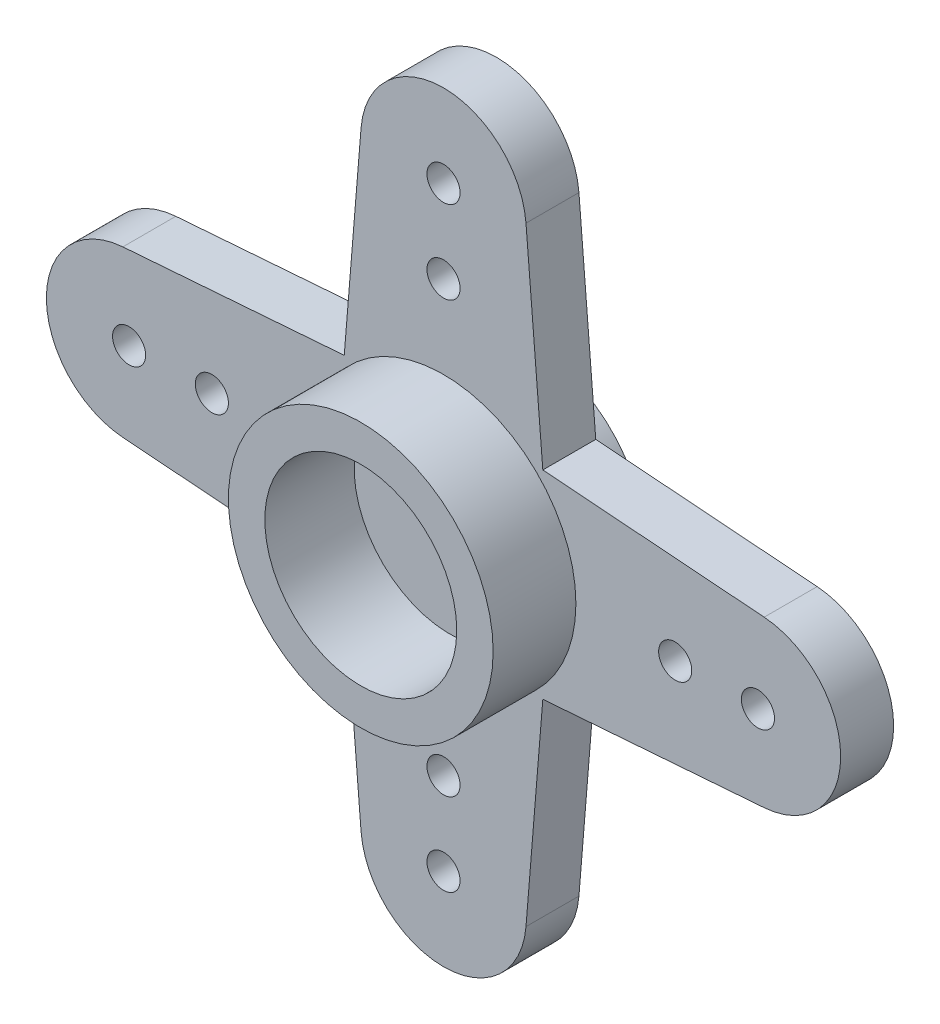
ISO-10303-21;
HEADER;
FILE_DESCRIPTION(('STEP AP214'),'2;1');
FILE_NAME('part.step','',(''),(''),'','','');
FILE_SCHEMA(('AUTOMOTIVE_DESIGN { 1 0 10303 214 1 1 1 1 }'));
ENDSEC;
DATA;
#1=APPLICATION_CONTEXT('core data for automotive mechanical design processes');
#2=APPLICATION_PROTOCOL_DEFINITION('international standard','automotive_design',2000,#1);
#3=PRODUCT_CONTEXT('',#1,'mechanical');
#4=PRODUCT('Part','Part','',(#3));
#5=PRODUCT_RELATED_PRODUCT_CATEGORY('part','',(#4));
#6=PRODUCT_DEFINITION_FORMATION('','',#4);
#7=PRODUCT_DEFINITION_CONTEXT('part definition',#1,'design');
#8=PRODUCT_DEFINITION('design','',#6,#7);
#9=PRODUCT_DEFINITION_SHAPE('','',#8);
#10=(LENGTH_UNIT() NAMED_UNIT(*) SI_UNIT(.MILLI.,.METRE.));
#11=(NAMED_UNIT(*) PLANE_ANGLE_UNIT() SI_UNIT($,.RADIAN.));
#12=(NAMED_UNIT(*) SI_UNIT($,.STERADIAN.) SOLID_ANGLE_UNIT());
#13=UNCERTAINTY_MEASURE_WITH_UNIT(LENGTH_MEASURE(1.E-05),#10,'distance_accuracy_value','');
#14=(GEOMETRIC_REPRESENTATION_CONTEXT(3) GLOBAL_UNCERTAINTY_ASSIGNED_CONTEXT((#13)) GLOBAL_UNIT_ASSIGNED_CONTEXT((#10,
#11,#12)) REPRESENTATION_CONTEXT('',''));
#15=CARTESIAN_POINT('',(0.,0.,0.));
#16=DIRECTION('',(0.,0.,1.));
#17=DIRECTION('',(1.,0.,0.));
#18=AXIS2_PLACEMENT_3D('',#15,#16,#17);
#19=CARTESIAN_POINT('',(0.,-9.,1.6));
#20=DIRECTION('',(0.,0.,1.));
#21=DIRECTION('',(1.,0.,0.));
#22=AXIS2_PLACEMENT_3D('',#19,#20,#21);
#23=PLANE('',#22);
#24=CARTESIAN_POINT('',(0.,-9.,1.6));
#25=DIRECTION('',(0.,0.,1.));
#26=DIRECTION('',(1.,0.,0.));
#27=AXIS2_PLACEMENT_3D('',#24,#25,#26);
#28=CIRCLE('',#27,0.5);
#29=CARTESIAN_POINT('',(0.5,-9.,1.6));
#30=VERTEX_POINT('',#29);
#31=EDGE_CURVE('E530',#30,#30,#28,.T.);
#32=ORIENTED_EDGE('',*,*,#31,.F.);
#33=EDGE_LOOP('',(#32));
#34=FACE_BOUND('',#33,.T.);
#35=CARTESIAN_POINT('',(0.,6.5,1.6));
#36=DIRECTION('',(0.,0.,1.));
#37=DIRECTION('',(1.,0.,0.));
#38=AXIS2_PLACEMENT_3D('',#35,#36,#37);
#39=CIRCLE('',#38,0.500000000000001);
#40=CARTESIAN_POINT('',(0.500000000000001,6.5,1.6));
#41=VERTEX_POINT('',#40);
#42=EDGE_CURVE('E542',#41,#41,#39,.T.);
#43=ORIENTED_EDGE('',*,*,#42,.F.);
#44=EDGE_LOOP('',(#43));
#45=FACE_BOUND('',#44,.T.);
#46=CARTESIAN_POINT('',(7.,0.,1.6));
#47=DIRECTION('',(0.,0.,1.));
#48=DIRECTION('',(1.,0.,0.));
#49=AXIS2_PLACEMENT_3D('',#46,#47,#48);
#50=CIRCLE('',#49,0.500000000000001);
#51=CARTESIAN_POINT('',(7.5,0.,1.6));
#52=VERTEX_POINT('',#51);
#53=EDGE_CURVE('E554',#52,#52,#50,.T.);
#54=ORIENTED_EDGE('',*,*,#53,.F.);
#55=EDGE_LOOP('',(#54));
#56=FACE_BOUND('',#55,.T.);
#57=CARTESIAN_POINT('',(-9.5,0.,1.6));
#58=DIRECTION('',(0.,0.,1.));
#59=DIRECTION('',(1.,0.,0.));
#60=AXIS2_PLACEMENT_3D('',#57,#58,#59);
#61=CIRCLE('',#60,0.500000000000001);
#62=CARTESIAN_POINT('',(-9.,0.,1.6));
#63=VERTEX_POINT('',#62);
#64=EDGE_CURVE('E566',#63,#63,#61,.T.);
#65=ORIENTED_EDGE('',*,*,#64,.F.);
#66=EDGE_LOOP('',(#65));
#67=FACE_BOUND('',#66,.T.);
#68=DIRECTION('',(0.0816633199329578,0.996659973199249,0.));
#69=VECTOR('',#68,1.);
#70=CARTESIAN_POINT('',(3.,-3.,1.6));
#71=LINE('',#70,#69);
#72=CARTESIAN_POINT('',(2.49164993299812,-9.20415829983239,1.6));
#73=VERTEX_POINT('',#72);
#74=CARTESIAN_POINT('',(3.,-3.,1.6));
#75=VERTEX_POINT('',#74);
#76=EDGE_CURVE('E179',#73,#75,#71,.T.);
#77=ORIENTED_EDGE('',*,*,#76,.T.);
#78=DIRECTION('',(0.997138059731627,0.0756021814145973,0.));
#79=VECTOR('',#78,1.);
#80=CARTESIAN_POINT('',(9.68900545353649,-2.49284514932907,1.6));
#81=LINE('',#80,#79);
#82=CARTESIAN_POINT('',(9.68900545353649,-2.49284514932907,1.6));
#83=VERTEX_POINT('',#82);
#84=EDGE_CURVE('E107',#75,#83,#81,.T.);
#85=ORIENTED_EDGE('',*,*,#84,.T.);
#86=CARTESIAN_POINT('',(9.5,0.,1.6));
#87=DIRECTION('',(0.,0.,1.));
#88=DIRECTION('',(1.,0.,0.));
#89=AXIS2_PLACEMENT_3D('',#86,#87,#88);
#90=CIRCLE('',#89,2.5);
#91=CARTESIAN_POINT('',(9.68900545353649,2.49284514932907,1.6));
#92=VERTEX_POINT('',#91);
#93=EDGE_CURVE('E225',#83,#92,#90,.T.);
#94=ORIENTED_EDGE('',*,*,#93,.T.);
#95=DIRECTION('',(-0.997138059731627,0.0756021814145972,0.));
#96=VECTOR('',#95,1.);
#97=CARTESIAN_POINT('',(3.,3.,1.6));
#98=LINE('',#97,#96);
#99=CARTESIAN_POINT('',(3.,3.,1.6));
#100=VERTEX_POINT('',#99);
#101=EDGE_CURVE('E222',#92,#100,#98,.T.);
#102=ORIENTED_EDGE('',*,*,#101,.T.);
#103=DIRECTION('',(-0.0816633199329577,0.996659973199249,0.));
#104=VECTOR('',#103,1.);
#105=CARTESIAN_POINT('',(3.,3.,1.6));
#106=LINE('',#105,#104);
#107=CARTESIAN_POINT('',(2.49164993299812,9.20415829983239,1.6));
#108=VERTEX_POINT('',#107);
#109=EDGE_CURVE('E224',#100,#108,#106,.T.);
#110=ORIENTED_EDGE('',*,*,#109,.T.);
#111=CARTESIAN_POINT('',(0.,9.,1.6));
#112=DIRECTION('',(0.,0.,1.));
#113=DIRECTION('',(1.,0.,0.));
#114=AXIS2_PLACEMENT_3D('',#111,#112,#113);
#115=CIRCLE('',#114,2.5);
#116=CARTESIAN_POINT('',(-2.49164993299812,9.20415829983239,1.6));
#117=VERTEX_POINT('',#116);
#118=EDGE_CURVE('E227',#108,#117,#115,.T.);
#119=ORIENTED_EDGE('',*,*,#118,.T.);
#120=DIRECTION('',(-0.0816633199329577,-0.996659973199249,0.));
#121=VECTOR('',#120,1.);
#122=CARTESIAN_POINT('',(-3.,3.,1.6));
#123=LINE('',#122,#121);
#124=CARTESIAN_POINT('',(-3.,3.,1.6));
#125=VERTEX_POINT('',#124);
#126=EDGE_CURVE('E233',#117,#125,#123,.T.);
#127=ORIENTED_EDGE('',*,*,#126,.T.);
#128=DIRECTION('',(-0.997138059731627,-0.0756021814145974,0.));
#129=VECTOR('',#128,1.);
#130=CARTESIAN_POINT('',(-9.68900545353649,2.49284514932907,1.6));
#131=LINE('',#130,#129);
#132=CARTESIAN_POINT('',(-9.68900545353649,2.49284514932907,1.6));
#133=VERTEX_POINT('',#132);
#134=EDGE_CURVE('E235',#125,#133,#131,.T.);
#135=ORIENTED_EDGE('',*,*,#134,.T.);
#136=CARTESIAN_POINT('',(-9.5,0.,1.6));
#137=DIRECTION('',(0.,0.,1.));
#138=DIRECTION('',(1.,0.,0.));
#139=AXIS2_PLACEMENT_3D('',#136,#137,#138);
#140=CIRCLE('',#139,2.5);
#141=CARTESIAN_POINT('',(-9.6890054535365,-2.49284514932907,1.6));
#142=VERTEX_POINT('',#141);
#143=EDGE_CURVE('E138',#133,#142,#140,.T.);
#144=ORIENTED_EDGE('',*,*,#143,.T.);
#145=DIRECTION('',(0.997138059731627,-0.0756021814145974,0.));
#146=VECTOR('',#145,1.);
#147=CARTESIAN_POINT('',(-9.68900545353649,-2.49284514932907,1.6));
#148=LINE('',#147,#146);
#149=CARTESIAN_POINT('',(-3.,-3.,1.6));
#150=VERTEX_POINT('',#149);
#151=EDGE_CURVE('E132',#142,#150,#148,.T.);
#152=ORIENTED_EDGE('',*,*,#151,.T.);
#153=DIRECTION('',(0.0816633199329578,-0.996659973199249,0.));
#154=VECTOR('',#153,1.);
#155=CARTESIAN_POINT('',(-3.,-3.,1.6));
#156=LINE('',#155,#154);
#157=CARTESIAN_POINT('',(-2.49164993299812,-9.20415829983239,1.6));
#158=VERTEX_POINT('',#157);
#159=EDGE_CURVE('E136',#150,#158,#156,.T.);
#160=ORIENTED_EDGE('',*,*,#159,.T.);
#161=CARTESIAN_POINT('',(0.,-9.,1.6));
#162=DIRECTION('',(0.,0.,1.));
#163=DIRECTION('',(1.,0.,0.));
#164=AXIS2_PLACEMENT_3D('',#161,#162,#163);
#165=CIRCLE('',#164,2.5);
#166=EDGE_CURVE('E51',#158,#73,#165,.T.);
#167=ORIENTED_EDGE('',*,*,#166,.T.);
#168=EDGE_LOOP('',(#77,#85,#94,#102,#110,#119,#127,#135,#144,#152,#160,#167));
#169=FACE_BOUND('',#168,.T.);
#170=CARTESIAN_POINT('',(0.,9.,1.6));
#171=DIRECTION('',(0.,0.,1.));
#172=DIRECTION('',(1.,0.,0.));
#173=AXIS2_PLACEMENT_3D('',#170,#171,#172);
#174=CIRCLE('',#173,0.500000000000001);
#175=CARTESIAN_POINT('',(0.500000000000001,9.,1.6));
#176=VERTEX_POINT('',#175);
#177=EDGE_CURVE('E160',#176,#176,#174,.T.);
#178=ORIENTED_EDGE('',*,*,#177,.F.);
#179=EDGE_LOOP('',(#178));
#180=FACE_BOUND('',#179,.T.);
#181=CARTESIAN_POINT('',(-7.,0.,1.6));
#182=DIRECTION('',(0.,0.,1.));
#183=DIRECTION('',(1.,0.,0.));
#184=AXIS2_PLACEMENT_3D('',#181,#182,#183);
#185=CIRCLE('',#184,0.500000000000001);
#186=CARTESIAN_POINT('',(-6.5,0.,1.6));
#187=VERTEX_POINT('',#186);
#188=EDGE_CURVE('E560',#187,#187,#185,.T.);
#189=ORIENTED_EDGE('',*,*,#188,.F.);
#190=EDGE_LOOP('',(#189));
#191=FACE_BOUND('',#190,.T.);
#192=CARTESIAN_POINT('',(9.5,0.,1.6));
#193=DIRECTION('',(0.,0.,1.));
#194=DIRECTION('',(1.,0.,0.));
#195=AXIS2_PLACEMENT_3D('',#192,#193,#194);
#196=CIRCLE('',#195,0.500000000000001);
#197=CARTESIAN_POINT('',(10.,0.,1.6));
#198=VERTEX_POINT('',#197);
#199=EDGE_CURVE('E548',#198,#198,#196,.T.);
#200=ORIENTED_EDGE('',*,*,#199,.F.);
#201=EDGE_LOOP('',(#200));
#202=FACE_BOUND('',#201,.T.);
#203=CARTESIAN_POINT('',(0.,-6.5,1.6));
#204=DIRECTION('',(0.,0.,1.));
#205=DIRECTION('',(1.,0.,0.));
#206=AXIS2_PLACEMENT_3D('',#203,#204,#205);
#207=CIRCLE('',#206,0.5);
#208=CARTESIAN_POINT('',(0.5,-6.5,1.6));
#209=VERTEX_POINT('',#208);
#210=EDGE_CURVE('E536',#209,#209,#207,.T.);
#211=ORIENTED_EDGE('',*,*,#210,.F.);
#212=EDGE_LOOP('',(#211));
#213=FACE_BOUND('',#212,.T.);
#214=CARTESIAN_POINT('',(0.,0.,1.6));
#215=DIRECTION('',(0.,0.,1.));
#216=DIRECTION('',(1.,0.,0.));
#217=AXIS2_PLACEMENT_3D('',#214,#215,#216);
#218=CIRCLE('',#217,4.);
#219=CARTESIAN_POINT('',(4.,0.,1.6));
#220=VERTEX_POINT('',#219);
#221=EDGE_CURVE('E515',#220,#220,#218,.T.);
#222=ORIENTED_EDGE('',*,*,#221,.F.);
#223=EDGE_LOOP('',(#222));
#224=FACE_BOUND('',#223,.T.);
#225=ADVANCED_FACE('F34',(#34,#45,#56,#67,#169,#180,#191,#202,#213,#224),#23,.T.);
#226=CARTESIAN_POINT('',(0.,-9.,0.));
#227=DIRECTION('',(0.,0.,1.));
#228=DIRECTION('',(1.,0.,0.));
#229=AXIS2_PLACEMENT_3D('',#226,#227,#228);
#230=PLANE('',#229);
#231=CARTESIAN_POINT('',(0.,-9.,0.));
#232=DIRECTION('',(0.,0.,1.));
#233=DIRECTION('',(1.,0.,0.));
#234=AXIS2_PLACEMENT_3D('',#231,#232,#233);
#235=CIRCLE('',#234,0.5);
#236=CARTESIAN_POINT('',(0.5,-9.,0.));
#237=VERTEX_POINT('',#236);
#238=EDGE_CURVE('E529',#237,#237,#235,.T.);
#239=ORIENTED_EDGE('',*,*,#238,.T.);
#240=EDGE_LOOP('',(#239));
#241=FACE_BOUND('',#240,.T.);
#242=CARTESIAN_POINT('',(0.,6.5,0.));
#243=DIRECTION('',(0.,0.,1.));
#244=DIRECTION('',(1.,0.,0.));
#245=AXIS2_PLACEMENT_3D('',#242,#243,#244);
#246=CIRCLE('',#245,0.500000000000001);
#247=CARTESIAN_POINT('',(0.500000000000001,6.5,0.));
#248=VERTEX_POINT('',#247);
#249=EDGE_CURVE('E539',#248,#248,#246,.T.);
#250=ORIENTED_EDGE('',*,*,#249,.T.);
#251=EDGE_LOOP('',(#250));
#252=FACE_BOUND('',#251,.T.);
#253=CARTESIAN_POINT('',(7.,0.,0.));
#254=DIRECTION('',(0.,0.,1.));
#255=DIRECTION('',(1.,0.,0.));
#256=AXIS2_PLACEMENT_3D('',#253,#254,#255);
#257=CIRCLE('',#256,0.500000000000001);
#258=CARTESIAN_POINT('',(7.5,0.,0.));
#259=VERTEX_POINT('',#258);
#260=EDGE_CURVE('E551',#259,#259,#257,.T.);
#261=ORIENTED_EDGE('',*,*,#260,.T.);
#262=EDGE_LOOP('',(#261));
#263=FACE_BOUND('',#262,.T.);
#264=CARTESIAN_POINT('',(-9.5,0.,0.));
#265=DIRECTION('',(0.,0.,1.));
#266=DIRECTION('',(1.,0.,0.));
#267=AXIS2_PLACEMENT_3D('',#264,#265,#266);
#268=CIRCLE('',#267,0.500000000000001);
#269=CARTESIAN_POINT('',(-9.,0.,0.));
#270=VERTEX_POINT('',#269);
#271=EDGE_CURVE('E563',#270,#270,#268,.T.);
#272=ORIENTED_EDGE('',*,*,#271,.T.);
#273=EDGE_LOOP('',(#272));
#274=FACE_BOUND('',#273,.T.);
#275=DIRECTION('',(0.0816633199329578,0.996659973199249,0.));
#276=VECTOR('',#275,1.);
#277=CARTESIAN_POINT('',(3.,-3.,0.));
#278=LINE('',#277,#276);
#279=CARTESIAN_POINT('',(2.49164993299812,-9.20415829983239,0.));
#280=VERTEX_POINT('',#279);
#281=CARTESIAN_POINT('',(3.,-3.,0.));
#282=VERTEX_POINT('',#281);
#283=EDGE_CURVE('E156',#280,#282,#278,.T.);
#284=ORIENTED_EDGE('',*,*,#283,.F.);
#285=CARTESIAN_POINT('',(0.,-9.,0.));
#286=DIRECTION('',(0.,0.,1.));
#287=DIRECTION('',(1.,0.,0.));
#288=AXIS2_PLACEMENT_3D('',#285,#286,#287);
#289=CIRCLE('',#288,2.5);
#290=CARTESIAN_POINT('',(-2.49164993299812,-9.20415829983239,0.));
#291=VERTEX_POINT('',#290);
#292=EDGE_CURVE('E98',#291,#280,#289,.T.);
#293=ORIENTED_EDGE('',*,*,#292,.F.);
#294=DIRECTION('',(0.0816633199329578,-0.996659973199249,0.));
#295=VECTOR('',#294,1.);
#296=CARTESIAN_POINT('',(-3.,-3.,0.));
#297=LINE('',#296,#295);
#298=CARTESIAN_POINT('',(-3.,-3.,0.));
#299=VERTEX_POINT('',#298);
#300=EDGE_CURVE('E92',#299,#291,#297,.T.);
#301=ORIENTED_EDGE('',*,*,#300,.F.);
#302=DIRECTION('',(0.997138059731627,-0.0756021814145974,0.));
#303=VECTOR('',#302,1.);
#304=CARTESIAN_POINT('',(-9.68900545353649,-2.49284514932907,0.));
#305=LINE('',#304,#303);
#306=CARTESIAN_POINT('',(-9.6890054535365,-2.49284514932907,0.));
#307=VERTEX_POINT('',#306);
#308=EDGE_CURVE('E146',#307,#299,#305,.T.);
#309=ORIENTED_EDGE('',*,*,#308,.F.);
#310=CARTESIAN_POINT('',(-9.5,0.,0.));
#311=DIRECTION('',(0.,0.,1.));
#312=DIRECTION('',(1.,0.,0.));
#313=AXIS2_PLACEMENT_3D('',#310,#311,#312);
#314=CIRCLE('',#313,2.5);
#315=CARTESIAN_POINT('',(-9.68900545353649,2.49284514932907,0.));
#316=VERTEX_POINT('',#315);
#317=EDGE_CURVE('E174',#316,#307,#314,.T.);
#318=ORIENTED_EDGE('',*,*,#317,.F.);
#319=DIRECTION('',(-0.997138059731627,-0.0756021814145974,0.));
#320=VECTOR('',#319,1.);
#321=CARTESIAN_POINT('',(-9.68900545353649,2.49284514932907,0.));
#322=LINE('',#321,#320);
#323=CARTESIAN_POINT('',(-3.,3.,0.));
#324=VERTEX_POINT('',#323);
#325=EDGE_CURVE('E172',#324,#316,#322,.T.);
#326=ORIENTED_EDGE('',*,*,#325,.F.);
#327=DIRECTION('',(-0.0816633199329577,-0.996659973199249,0.));
#328=VECTOR('',#327,1.);
#329=CARTESIAN_POINT('',(-3.,3.,0.));
#330=LINE('',#329,#328);
#331=CARTESIAN_POINT('',(-2.49164993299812,9.20415829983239,0.));
#332=VERTEX_POINT('',#331);
#333=EDGE_CURVE('E170',#332,#324,#330,.T.);
#334=ORIENTED_EDGE('',*,*,#333,.F.);
#335=CARTESIAN_POINT('',(0.,9.,0.));
#336=DIRECTION('',(0.,0.,1.));
#337=DIRECTION('',(1.,0.,0.));
#338=AXIS2_PLACEMENT_3D('',#335,#336,#337);
#339=CIRCLE('',#338,2.5);
#340=CARTESIAN_POINT('',(2.49164993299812,9.20415829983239,0.));
#341=VERTEX_POINT('',#340);
#342=EDGE_CURVE('E168',#341,#332,#339,.T.);
#343=ORIENTED_EDGE('',*,*,#342,.F.);
#344=DIRECTION('',(-0.0816633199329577,0.996659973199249,0.));
#345=VECTOR('',#344,1.);
#346=CARTESIAN_POINT('',(3.,3.,0.));
#347=LINE('',#346,#345);
#348=CARTESIAN_POINT('',(3.,3.,0.));
#349=VERTEX_POINT('',#348);
#350=EDGE_CURVE('E166',#349,#341,#347,.T.);
#351=ORIENTED_EDGE('',*,*,#350,.F.);
#352=DIRECTION('',(-0.997138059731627,0.0756021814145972,0.));
#353=VECTOR('',#352,1.);
#354=CARTESIAN_POINT('',(3.,3.,0.));
#355=LINE('',#354,#353);
#356=CARTESIAN_POINT('',(9.68900545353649,2.49284514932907,0.));
#357=VERTEX_POINT('',#356);
#358=EDGE_CURVE('E164',#357,#349,#355,.T.);
#359=ORIENTED_EDGE('',*,*,#358,.F.);
#360=CARTESIAN_POINT('',(9.5,0.,0.));
#361=DIRECTION('',(0.,0.,1.));
#362=DIRECTION('',(1.,0.,0.));
#363=AXIS2_PLACEMENT_3D('',#360,#361,#362);
#364=CIRCLE('',#363,2.5);
#365=CARTESIAN_POINT('',(9.68900545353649,-2.49284514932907,0.));
#366=VERTEX_POINT('',#365);
#367=EDGE_CURVE('E162',#366,#357,#364,.T.);
#368=ORIENTED_EDGE('',*,*,#367,.F.);
#369=DIRECTION('',(0.997138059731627,0.0756021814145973,0.));
#370=VECTOR('',#369,1.);
#371=CARTESIAN_POINT('',(9.68900545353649,-2.49284514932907,0.));
#372=LINE('',#371,#370);
#373=EDGE_CURVE('E159',#282,#366,#372,.T.);
#374=ORIENTED_EDGE('',*,*,#373,.F.);
#375=EDGE_LOOP('',(#284,#293,#301,#309,#318,#326,#334,#343,#351,#359,#368,#374));
#376=FACE_BOUND('',#375,.T.);
#377=CARTESIAN_POINT('',(0.,9.,0.));
#378=DIRECTION('',(0.,0.,1.));
#379=DIRECTION('',(1.,0.,0.));
#380=AXIS2_PLACEMENT_3D('',#377,#378,#379);
#381=CIRCLE('',#380,0.500000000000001);
#382=CARTESIAN_POINT('',(0.500000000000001,9.,0.));
#383=VERTEX_POINT('',#382);
#384=EDGE_CURVE('E569',#383,#383,#381,.T.);
#385=ORIENTED_EDGE('',*,*,#384,.T.);
#386=EDGE_LOOP('',(#385));
#387=FACE_BOUND('',#386,.T.);
#388=CARTESIAN_POINT('',(-7.,0.,0.));
#389=DIRECTION('',(0.,0.,1.));
#390=DIRECTION('',(1.,0.,0.));
#391=AXIS2_PLACEMENT_3D('',#388,#389,#390);
#392=CIRCLE('',#391,0.500000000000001);
#393=CARTESIAN_POINT('',(-6.5,0.,0.));
#394=VERTEX_POINT('',#393);
#395=EDGE_CURVE('E557',#394,#394,#392,.T.);
#396=ORIENTED_EDGE('',*,*,#395,.T.);
#397=EDGE_LOOP('',(#396));
#398=FACE_BOUND('',#397,.T.);
#399=CARTESIAN_POINT('',(9.5,0.,0.));
#400=DIRECTION('',(0.,0.,1.));
#401=DIRECTION('',(1.,0.,0.));
#402=AXIS2_PLACEMENT_3D('',#399,#400,#401);
#403=CIRCLE('',#402,0.500000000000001);
#404=CARTESIAN_POINT('',(10.,0.,0.));
#405=VERTEX_POINT('',#404);
#406=EDGE_CURVE('E545',#405,#405,#403,.T.);
#407=ORIENTED_EDGE('',*,*,#406,.T.);
#408=EDGE_LOOP('',(#407));
#409=FACE_BOUND('',#408,.T.);
#410=CARTESIAN_POINT('',(0.,-6.5,0.));
#411=DIRECTION('',(0.,0.,1.));
#412=DIRECTION('',(1.,0.,0.));
#413=AXIS2_PLACEMENT_3D('',#410,#411,#412);
#414=CIRCLE('',#413,0.5);
#415=CARTESIAN_POINT('',(0.5,-6.5,0.));
#416=VERTEX_POINT('',#415);
#417=EDGE_CURVE('E533',#416,#416,#414,.T.);
#418=ORIENTED_EDGE('',*,*,#417,.T.);
#419=EDGE_LOOP('',(#418));
#420=FACE_BOUND('',#419,.T.);
#421=CARTESIAN_POINT('',(0.,0.,0.));
#422=DIRECTION('',(0.,0.,1.));
#423=DIRECTION('',(1.,0.,0.));
#424=AXIS2_PLACEMENT_3D('',#421,#422,#423);
#425=CIRCLE('',#424,3.5);
#426=CARTESIAN_POINT('',(3.5,0.,0.));
#427=VERTEX_POINT('',#426);
#428=EDGE_CURVE('E11',#427,#427,#425,.F.);
#429=ORIENTED_EDGE('',*,*,#428,.F.);
#430=EDGE_LOOP('',(#429));
#431=FACE_BOUND('',#430,.T.);
#432=ADVANCED_FACE('F209',(#241,#252,#263,#274,#376,#387,#398,#409,#420,#431),#230,.F.);
#433=CARTESIAN_POINT('',(3.,-3.,1.6));
#434=DIRECTION('',(-0.996659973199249,0.0816633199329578,0.));
#435=DIRECTION('',(-0.0816633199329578,-0.996659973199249,0.));
#436=AXIS2_PLACEMENT_3D('',#433,#434,#435);
#437=PLANE('',#436);
#438=ORIENTED_EDGE('',*,*,#283,.T.);
#439=DIRECTION('',(0.,0.,-1.));
#440=VECTOR('',#439,1.);
#441=CARTESIAN_POINT('',(3.,-3.,1.6));
#442=LINE('',#441,#440);
#443=EDGE_CURVE('E43',#75,#282,#442,.T.);
#444=ORIENTED_EDGE('',*,*,#443,.F.);
#445=ORIENTED_EDGE('',*,*,#76,.F.);
#446=DIRECTION('',(0.,0.,-1.));
#447=VECTOR('',#446,1.);
#448=CARTESIAN_POINT('',(2.49164993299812,-9.20415829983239,1.6));
#449=LINE('',#448,#447);
#450=EDGE_CURVE('E152',#73,#280,#449,.T.);
#451=ORIENTED_EDGE('',*,*,#450,.T.);
#452=EDGE_LOOP('',(#438,#444,#445,#451));
#453=FACE_BOUND('',#452,.T.);
#454=ADVANCED_FACE('F36',(#453),#437,.F.);
#455=CARTESIAN_POINT('',(9.68900545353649,-2.49284514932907,1.6));
#456=DIRECTION('',(-0.0756021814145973,0.997138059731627,0.));
#457=DIRECTION('',(-0.997138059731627,-0.0756021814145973,0.));
#458=AXIS2_PLACEMENT_3D('',#455,#456,#457);
#459=PLANE('',#458);
#460=ORIENTED_EDGE('',*,*,#373,.T.);
#461=DIRECTION('',(0.,0.,-1.));
#462=VECTOR('',#461,1.);
#463=CARTESIAN_POINT('',(9.68900545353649,-2.49284514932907,1.6));
#464=LINE('',#463,#462);
#465=EDGE_CURVE('E201',#83,#366,#464,.T.);
#466=ORIENTED_EDGE('',*,*,#465,.F.);
#467=ORIENTED_EDGE('',*,*,#84,.F.);
#468=ORIENTED_EDGE('',*,*,#443,.T.);
#469=EDGE_LOOP('',(#460,#466,#467,#468));
#470=FACE_BOUND('',#469,.T.);
#471=ADVANCED_FACE('F204',(#470),#459,.F.);
#472=CARTESIAN_POINT('',(9.5,0.,1.6));
#473=DIRECTION('',(0.,0.,-1.));
#474=DIRECTION('',(-1.,0.,0.));
#475=AXIS2_PLACEMENT_3D('',#472,#473,#474);
#476=CYLINDRICAL_SURFACE('',#475,2.5);
#477=ORIENTED_EDGE('',*,*,#367,.T.);
#478=DIRECTION('',(0.,0.,-1.));
#479=VECTOR('',#478,1.);
#480=CARTESIAN_POINT('',(9.68900545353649,2.49284514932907,1.6));
#481=LINE('',#480,#479);
#482=EDGE_CURVE('E198',#92,#357,#481,.T.);
#483=ORIENTED_EDGE('',*,*,#482,.F.);
#484=ORIENTED_EDGE('',*,*,#93,.F.);
#485=ORIENTED_EDGE('',*,*,#465,.T.);
#486=EDGE_LOOP('',(#477,#483,#484,#485));
#487=FACE_BOUND('',#486,.T.);
#488=ADVANCED_FACE('F216',(#487),#476,.T.);
#489=CARTESIAN_POINT('',(3.,3.,1.6));
#490=DIRECTION('',(-0.0756021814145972,-0.997138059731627,0.));
#491=DIRECTION('',(0.997138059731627,-0.0756021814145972,0.));
#492=AXIS2_PLACEMENT_3D('',#489,#490,#491);
#493=PLANE('',#492);
#494=ORIENTED_EDGE('',*,*,#358,.T.);
#495=DIRECTION('',(0.,0.,-1.));
#496=VECTOR('',#495,1.);
#497=CARTESIAN_POINT('',(3.,3.,1.6));
#498=LINE('',#497,#496);
#499=EDGE_CURVE('E195',#100,#349,#498,.T.);
#500=ORIENTED_EDGE('',*,*,#499,.F.);
#501=ORIENTED_EDGE('',*,*,#101,.F.);
#502=ORIENTED_EDGE('',*,*,#482,.T.);
#503=EDGE_LOOP('',(#494,#500,#501,#502));
#504=FACE_BOUND('',#503,.T.);
#505=ADVANCED_FACE('F220',(#504),#493,.F.);
#506=CARTESIAN_POINT('',(3.,3.,1.6));
#507=DIRECTION('',(-0.996659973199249,-0.0816633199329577,0.));
#508=DIRECTION('',(0.0816633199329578,-0.996659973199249,0.));
#509=AXIS2_PLACEMENT_3D('',#506,#507,#508);
#510=PLANE('',#509);
#511=ORIENTED_EDGE('',*,*,#350,.T.);
#512=DIRECTION('',(0.,0.,-1.));
#513=VECTOR('',#512,1.);
#514=CARTESIAN_POINT('',(2.49164993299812,9.20415829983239,1.6));
#515=LINE('',#514,#513);
#516=EDGE_CURVE('E192',#108,#341,#515,.T.);
#517=ORIENTED_EDGE('',*,*,#516,.F.);
#518=ORIENTED_EDGE('',*,*,#109,.F.);
#519=ORIENTED_EDGE('',*,*,#499,.T.);
#520=EDGE_LOOP('',(#511,#517,#518,#519));
#521=FACE_BOUND('',#520,.T.);
#522=ADVANCED_FACE('F256',(#521),#510,.F.);
#523=CARTESIAN_POINT('',(0.,9.,1.6));
#524=DIRECTION('',(0.,0.,-1.));
#525=DIRECTION('',(-1.,0.,0.));
#526=AXIS2_PLACEMENT_3D('',#523,#524,#525);
#527=CYLINDRICAL_SURFACE('',#526,2.5);
#528=ORIENTED_EDGE('',*,*,#342,.T.);
#529=DIRECTION('',(0.,0.,-1.));
#530=VECTOR('',#529,1.);
#531=CARTESIAN_POINT('',(-2.49164993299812,9.20415829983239,1.6));
#532=LINE('',#531,#530);
#533=EDGE_CURVE('E189',#117,#332,#532,.T.);
#534=ORIENTED_EDGE('',*,*,#533,.F.);
#535=ORIENTED_EDGE('',*,*,#118,.F.);
#536=ORIENTED_EDGE('',*,*,#516,.T.);
#537=EDGE_LOOP('',(#528,#534,#535,#536));
#538=FACE_BOUND('',#537,.T.);
#539=ADVANCED_FACE('F253',(#538),#527,.T.);
#540=CARTESIAN_POINT('',(-3.,3.,1.6));
#541=DIRECTION('',(0.996659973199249,-0.0816633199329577,0.));
#542=DIRECTION('',(0.0816633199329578,0.996659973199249,0.));
#543=AXIS2_PLACEMENT_3D('',#540,#541,#542);
#544=PLANE('',#543);
#545=ORIENTED_EDGE('',*,*,#333,.T.);
#546=DIRECTION('',(0.,0.,-1.));
#547=VECTOR('',#546,1.);
#548=CARTESIAN_POINT('',(-3.,3.,1.6));
#549=LINE('',#548,#547);
#550=EDGE_CURVE('E186',#125,#324,#549,.T.);
#551=ORIENTED_EDGE('',*,*,#550,.F.);
#552=ORIENTED_EDGE('',*,*,#126,.F.);
#553=ORIENTED_EDGE('',*,*,#533,.T.);
#554=EDGE_LOOP('',(#545,#551,#552,#553));
#555=FACE_BOUND('',#554,.T.);
#556=ADVANCED_FACE('F249',(#555),#544,.F.);
#557=CARTESIAN_POINT('',(-9.68900545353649,2.49284514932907,1.6));
#558=DIRECTION('',(0.0756021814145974,-0.997138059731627,0.));
#559=DIRECTION('',(0.997138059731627,0.0756021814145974,0.));
#560=AXIS2_PLACEMENT_3D('',#557,#558,#559);
#561=PLANE('',#560);
#562=ORIENTED_EDGE('',*,*,#325,.T.);
#563=DIRECTION('',(0.,0.,-1.));
#564=VECTOR('',#563,1.);
#565=CARTESIAN_POINT('',(-9.68900545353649,2.49284514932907,1.6));
#566=LINE('',#565,#564);
#567=EDGE_CURVE('E183',#133,#316,#566,.T.);
#568=ORIENTED_EDGE('',*,*,#567,.F.);
#569=ORIENTED_EDGE('',*,*,#134,.F.);
#570=ORIENTED_EDGE('',*,*,#550,.T.);
#571=EDGE_LOOP('',(#562,#568,#569,#570));
#572=FACE_BOUND('',#571,.T.);
#573=ADVANCED_FACE('F241',(#572),#561,.F.);
#574=CARTESIAN_POINT('',(-9.5,0.,1.6));
#575=DIRECTION('',(0.,0.,-1.));
#576=DIRECTION('',(-1.,0.,0.));
#577=AXIS2_PLACEMENT_3D('',#574,#575,#576);
#578=CYLINDRICAL_SURFACE('',#577,2.5);
#579=ORIENTED_EDGE('',*,*,#317,.T.);
#580=DIRECTION('',(0.,0.,-1.));
#581=VECTOR('',#580,1.);
#582=CARTESIAN_POINT('',(-9.6890054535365,-2.49284514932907,1.6));
#583=LINE('',#582,#581);
#584=EDGE_CURVE('E147',#142,#307,#583,.T.);
#585=ORIENTED_EDGE('',*,*,#584,.F.);
#586=ORIENTED_EDGE('',*,*,#143,.F.);
#587=ORIENTED_EDGE('',*,*,#567,.T.);
#588=EDGE_LOOP('',(#579,#585,#586,#587));
#589=FACE_BOUND('',#588,.T.);
#590=ADVANCED_FACE('F245',(#589),#578,.T.);
#591=CARTESIAN_POINT('',(-9.68900545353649,-2.49284514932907,1.6));
#592=DIRECTION('',(0.0756021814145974,0.997138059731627,0.));
#593=DIRECTION('',(-0.997138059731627,0.0756021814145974,0.));
#594=AXIS2_PLACEMENT_3D('',#591,#592,#593);
#595=PLANE('',#594);
#596=ORIENTED_EDGE('',*,*,#308,.T.);
#597=DIRECTION('',(0.,0.,-1.));
#598=VECTOR('',#597,1.);
#599=CARTESIAN_POINT('',(-3.,-3.,1.6));
#600=LINE('',#599,#598);
#601=EDGE_CURVE('E143',#150,#299,#600,.T.);
#602=ORIENTED_EDGE('',*,*,#601,.F.);
#603=ORIENTED_EDGE('',*,*,#151,.F.);
#604=ORIENTED_EDGE('',*,*,#584,.T.);
#605=EDGE_LOOP('',(#596,#602,#603,#604));
#606=FACE_BOUND('',#605,.T.);
#607=ADVANCED_FACE('F144',(#606),#595,.F.);
#608=CARTESIAN_POINT('',(-3.,-3.,1.6));
#609=DIRECTION('',(0.996659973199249,0.0816633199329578,0.));
#610=DIRECTION('',(-0.0816633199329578,0.996659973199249,0.));
#611=AXIS2_PLACEMENT_3D('',#608,#609,#610);
#612=PLANE('',#611);
#613=ORIENTED_EDGE('',*,*,#300,.T.);
#614=DIRECTION('',(0.,0.,-1.));
#615=VECTOR('',#614,1.);
#616=CARTESIAN_POINT('',(-2.49164993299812,-9.20415829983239,1.6));
#617=LINE('',#616,#615);
#618=EDGE_CURVE('E148',#158,#291,#617,.T.);
#619=ORIENTED_EDGE('',*,*,#618,.F.);
#620=ORIENTED_EDGE('',*,*,#159,.F.);
#621=ORIENTED_EDGE('',*,*,#601,.T.);
#622=EDGE_LOOP('',(#613,#619,#620,#621));
#623=FACE_BOUND('',#622,.T.);
#624=ADVANCED_FACE('F150',(#623),#612,.F.);
#625=CARTESIAN_POINT('',(0.,-9.,1.6));
#626=DIRECTION('',(0.,0.,-1.));
#627=DIRECTION('',(-1.,0.,0.));
#628=AXIS2_PLACEMENT_3D('',#625,#626,#627);
#629=CYLINDRICAL_SURFACE('',#628,2.5);
#630=ORIENTED_EDGE('',*,*,#292,.T.);
#631=ORIENTED_EDGE('',*,*,#450,.F.);
#632=ORIENTED_EDGE('',*,*,#166,.F.);
#633=ORIENTED_EDGE('',*,*,#618,.T.);
#634=EDGE_LOOP('',(#630,#631,#632,#633));
#635=FACE_BOUND('',#634,.T.);
#636=ADVANCED_FACE('F279',(#635),#629,.T.);
#637=CARTESIAN_POINT('',(0.,9.,1.6));
#638=DIRECTION('',(0.,0.,-1.));
#639=DIRECTION('',(-1.,0.,0.));
#640=AXIS2_PLACEMENT_3D('',#637,#638,#639);
#641=CYLINDRICAL_SURFACE('',#640,0.500000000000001);
#642=ORIENTED_EDGE('',*,*,#177,.T.);
#643=EDGE_LOOP('',(#642));
#644=FACE_BOUND('',#643,.T.);
#645=ORIENTED_EDGE('',*,*,#384,.F.);
#646=EDGE_LOOP('',(#645));
#647=FACE_BOUND('',#646,.T.);
#648=ADVANCED_FACE('F276',(#644,#647),#641,.F.);
#649=CARTESIAN_POINT('',(-9.5,0.,1.6));
#650=DIRECTION('',(0.,0.,-1.));
#651=DIRECTION('',(-1.,0.,0.));
#652=AXIS2_PLACEMENT_3D('',#649,#650,#651);
#653=CYLINDRICAL_SURFACE('',#652,0.500000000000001);
#654=ORIENTED_EDGE('',*,*,#64,.T.);
#655=EDGE_LOOP('',(#654));
#656=FACE_BOUND('',#655,.T.);
#657=ORIENTED_EDGE('',*,*,#271,.F.);
#658=EDGE_LOOP('',(#657));
#659=FACE_BOUND('',#658,.T.);
#660=ADVANCED_FACE('F321',(#656,#659),#653,.F.);
#661=CARTESIAN_POINT('',(-7.,0.,1.6));
#662=DIRECTION('',(0.,0.,-1.));
#663=DIRECTION('',(-1.,0.,0.));
#664=AXIS2_PLACEMENT_3D('',#661,#662,#663);
#665=CYLINDRICAL_SURFACE('',#664,0.500000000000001);
#666=ORIENTED_EDGE('',*,*,#188,.T.);
#667=EDGE_LOOP('',(#666));
#668=FACE_BOUND('',#667,.T.);
#669=ORIENTED_EDGE('',*,*,#395,.F.);
#670=EDGE_LOOP('',(#669));
#671=FACE_BOUND('',#670,.T.);
#672=ADVANCED_FACE('F328',(#668,#671),#665,.F.);
#673=CARTESIAN_POINT('',(7.,0.,1.6));
#674=DIRECTION('',(0.,0.,-1.));
#675=DIRECTION('',(-1.,0.,0.));
#676=AXIS2_PLACEMENT_3D('',#673,#674,#675);
#677=CYLINDRICAL_SURFACE('',#676,0.500000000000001);
#678=ORIENTED_EDGE('',*,*,#53,.T.);
#679=EDGE_LOOP('',(#678));
#680=FACE_BOUND('',#679,.T.);
#681=ORIENTED_EDGE('',*,*,#260,.F.);
#682=EDGE_LOOP('',(#681));
#683=FACE_BOUND('',#682,.T.);
#684=ADVANCED_FACE('F335',(#680,#683),#677,.F.);
#685=CARTESIAN_POINT('',(9.5,0.,1.6));
#686=DIRECTION('',(0.,0.,-1.));
#687=DIRECTION('',(-1.,0.,0.));
#688=AXIS2_PLACEMENT_3D('',#685,#686,#687);
#689=CYLINDRICAL_SURFACE('',#688,0.500000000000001);
#690=ORIENTED_EDGE('',*,*,#199,.T.);
#691=EDGE_LOOP('',(#690));
#692=FACE_BOUND('',#691,.T.);
#693=ORIENTED_EDGE('',*,*,#406,.F.);
#694=EDGE_LOOP('',(#693));
#695=FACE_BOUND('',#694,.T.);
#696=ADVANCED_FACE('F343',(#692,#695),#689,.F.);
#697=CARTESIAN_POINT('',(0.,6.5,1.6));
#698=DIRECTION('',(0.,0.,-1.));
#699=DIRECTION('',(-1.,0.,0.));
#700=AXIS2_PLACEMENT_3D('',#697,#698,#699);
#701=CYLINDRICAL_SURFACE('',#700,0.500000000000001);
#702=ORIENTED_EDGE('',*,*,#42,.T.);
#703=EDGE_LOOP('',(#702));
#704=FACE_BOUND('',#703,.T.);
#705=ORIENTED_EDGE('',*,*,#249,.F.);
#706=EDGE_LOOP('',(#705));
#707=FACE_BOUND('',#706,.T.);
#708=ADVANCED_FACE('F351',(#704,#707),#701,.F.);
#709=CARTESIAN_POINT('',(0.,-6.5,1.6));
#710=DIRECTION('',(0.,0.,-1.));
#711=DIRECTION('',(-1.,0.,0.));
#712=AXIS2_PLACEMENT_3D('',#709,#710,#711);
#713=CYLINDRICAL_SURFACE('',#712,0.5);
#714=ORIENTED_EDGE('',*,*,#210,.T.);
#715=EDGE_LOOP('',(#714));
#716=FACE_BOUND('',#715,.T.);
#717=ORIENTED_EDGE('',*,*,#417,.F.);
#718=EDGE_LOOP('',(#717));
#719=FACE_BOUND('',#718,.T.);
#720=ADVANCED_FACE('F359',(#716,#719),#713,.F.);
#721=CARTESIAN_POINT('',(0.,-9.,1.6));
#722=DIRECTION('',(0.,0.,-1.));
#723=DIRECTION('',(-1.,0.,0.));
#724=AXIS2_PLACEMENT_3D('',#721,#722,#723);
#725=CYLINDRICAL_SURFACE('',#724,0.5);
#726=ORIENTED_EDGE('',*,*,#31,.T.);
#727=EDGE_LOOP('',(#726));
#728=FACE_BOUND('',#727,.T.);
#729=ORIENTED_EDGE('',*,*,#238,.F.);
#730=EDGE_LOOP('',(#729));
#731=FACE_BOUND('',#730,.T.);
#732=ADVANCED_FACE('F367',(#728,#731),#725,.F.);
#733=CARTESIAN_POINT('',(0.,0.,-1.));
#734=DIRECTION('',(0.,0.,1.));
#735=DIRECTION('',(1.,0.,0.));
#736=AXIS2_PLACEMENT_3D('',#733,#734,#735);
#737=CYLINDRICAL_SURFACE('',#736,3.5);
#738=CARTESIAN_POINT('',(0.,0.,-1.));
#739=DIRECTION('',(0.,0.,-1.));
#740=DIRECTION('',(-1.,0.,0.));
#741=AXIS2_PLACEMENT_3D('',#738,#739,#740);
#742=CIRCLE('',#741,3.5);
#743=CARTESIAN_POINT('',(-3.5,0.,-1.));
#744=VERTEX_POINT('',#743);
#745=EDGE_CURVE('E525',#744,#744,#742,.T.);
#746=ORIENTED_EDGE('',*,*,#745,.F.);
#747=EDGE_LOOP('',(#746));
#748=FACE_BOUND('',#747,.T.);
#749=ORIENTED_EDGE('',*,*,#428,.T.);
#750=EDGE_LOOP('',(#749));
#751=FACE_BOUND('',#750,.T.);
#752=ADVANCED_FACE('F375',(#748,#751),#737,.T.);
#753=CARTESIAN_POINT('',(0.,0.,-1.));
#754=DIRECTION('',(0.,0.,-1.));
#755=DIRECTION('',(-1.,0.,0.));
#756=AXIS2_PLACEMENT_3D('',#753,#754,#755);
#757=PLANE('',#756);
#758=ORIENTED_EDGE('',*,*,#745,.T.);
#759=EDGE_LOOP('',(#758));
#760=FACE_BOUND('',#759,.T.);
#761=ADVANCED_FACE('F384',(#760),#757,.T.);
#762=CARTESIAN_POINT('',(0.,0.,4.1));
#763=DIRECTION('',(0.,0.,-1.));
#764=DIRECTION('',(-1.,0.,0.));
#765=AXIS2_PLACEMENT_3D('',#762,#763,#764);
#766=CYLINDRICAL_SURFACE('',#765,4.);
#767=CARTESIAN_POINT('',(0.,0.,4.1));
#768=DIRECTION('',(0.,0.,1.));
#769=DIRECTION('',(1.,0.,0.));
#770=AXIS2_PLACEMENT_3D('',#767,#768,#769);
#771=CIRCLE('',#770,4.);
#772=CARTESIAN_POINT('',(4.,0.,4.1));
#773=VERTEX_POINT('',#772);
#774=EDGE_CURVE('E519',#773,#773,#771,.T.);
#775=ORIENTED_EDGE('',*,*,#774,.F.);
#776=EDGE_LOOP('',(#775));
#777=FACE_BOUND('',#776,.T.);
#778=ORIENTED_EDGE('',*,*,#221,.T.);
#779=EDGE_LOOP('',(#778));
#780=FACE_BOUND('',#779,.T.);
#781=ADVANCED_FACE('F392',(#777,#780),#766,.T.);
#782=CARTESIAN_POINT('',(0.,0.,4.1));
#783=DIRECTION('',(0.,0.,1.));
#784=DIRECTION('',(1.,0.,0.));
#785=AXIS2_PLACEMENT_3D('',#782,#783,#784);
#786=PLANE('',#785);
#787=CARTESIAN_POINT('',(0.,0.,4.1));
#788=DIRECTION('',(0.,0.,1.));
#789=DIRECTION('',(1.,0.,0.));
#790=AXIS2_PLACEMENT_3D('',#787,#788,#789);
#791=CIRCLE('',#790,2.9);
#792=CARTESIAN_POINT('',(2.9,0.,4.1));
#793=VERTEX_POINT('',#792);
#794=EDGE_CURVE('E516',#793,#793,#791,.T.);
#795=ORIENTED_EDGE('',*,*,#794,.F.);
#796=EDGE_LOOP('',(#795));
#797=FACE_BOUND('',#796,.T.);
#798=ORIENTED_EDGE('',*,*,#774,.T.);
#799=EDGE_LOOP('',(#798));
#800=FACE_BOUND('',#799,.T.);
#801=ADVANCED_FACE('F400',(#797,#800),#786,.T.);
#802=CARTESIAN_POINT('',(0.,0.,1.4));
#803=DIRECTION('',(0.,0.,1.));
#804=DIRECTION('',(1.,0.,0.));
#805=AXIS2_PLACEMENT_3D('',#802,#803,#804);
#806=CYLINDRICAL_SURFACE('',#805,2.9);
#807=CARTESIAN_POINT('',(0.,0.,1.4));
#808=DIRECTION('',(0.,0.,1.));
#809=DIRECTION('',(1.,0.,0.));
#810=AXIS2_PLACEMENT_3D('',#807,#808,#809);
#811=CIRCLE('',#810,2.9);
#812=CARTESIAN_POINT('',(2.9,0.,1.4));
#813=VERTEX_POINT('',#812);
#814=EDGE_CURVE('E514',#813,#813,#811,.T.);
#815=CARTESIAN_POINT('',(2.9,0.,1.4));
#816=CARTESIAN_POINT('',(2.9,0.,1.428125));
#817=CARTESIAN_POINT('',(2.9,0.,1.45625));
#818=CARTESIAN_POINT('',(2.9,0.,1.5125));
#819=CARTESIAN_POINT('',(2.9,0.,1.540625));
#820=CARTESIAN_POINT('',(2.9,0.,1.596875));
#821=CARTESIAN_POINT('',(2.9,0.,1.625));
#822=CARTESIAN_POINT('',(2.9,0.,1.68125));
#823=CARTESIAN_POINT('',(2.9,0.,1.709375));
#824=CARTESIAN_POINT('',(2.9,0.,1.765625));
#825=CARTESIAN_POINT('',(2.9,0.,1.79375));
#826=CARTESIAN_POINT('',(2.9,0.,1.85));
#827=CARTESIAN_POINT('',(2.9,0.,1.878125));
#828=CARTESIAN_POINT('',(2.9,0.,1.934375));
#829=CARTESIAN_POINT('',(2.9,0.,1.9625));
#830=CARTESIAN_POINT('',(2.9,0.,2.01875));
#831=CARTESIAN_POINT('',(2.9,0.,2.046875));
#832=CARTESIAN_POINT('',(2.9,0.,2.103125));
#833=CARTESIAN_POINT('',(2.9,0.,2.13125));
#834=CARTESIAN_POINT('',(2.9,0.,2.1875));
#835=CARTESIAN_POINT('',(2.9,0.,2.215625));
#836=CARTESIAN_POINT('',(2.9,0.,2.271875));
#837=CARTESIAN_POINT('',(2.9,0.,2.3));
#838=CARTESIAN_POINT('',(2.9,0.,2.35625));
#839=CARTESIAN_POINT('',(2.9,0.,2.384375));
#840=CARTESIAN_POINT('',(2.9,0.,2.440625));
#841=CARTESIAN_POINT('',(2.9,0.,2.46875));
#842=CARTESIAN_POINT('',(2.9,0.,2.525));
#843=CARTESIAN_POINT('',(2.9,0.,2.553125));
#844=CARTESIAN_POINT('',(2.9,0.,2.609375));
#845=CARTESIAN_POINT('',(2.9,0.,2.6375));
#846=CARTESIAN_POINT('',(2.9,0.,2.69375));
#847=CARTESIAN_POINT('',(2.9,0.,2.721875));
#848=CARTESIAN_POINT('',(2.9,0.,2.778125));
#849=CARTESIAN_POINT('',(2.9,0.,2.80625));
#850=CARTESIAN_POINT('',(2.9,0.,2.8625));
#851=CARTESIAN_POINT('',(2.9,0.,2.890625));
#852=CARTESIAN_POINT('',(2.9,0.,2.946875));
#853=CARTESIAN_POINT('',(2.9,0.,2.975));
#854=CARTESIAN_POINT('',(2.9,0.,3.03125));
#855=CARTESIAN_POINT('',(2.9,0.,3.059375));
#856=CARTESIAN_POINT('',(2.9,0.,3.115625));
#857=CARTESIAN_POINT('',(2.9,0.,3.14375));
#858=CARTESIAN_POINT('',(2.9,0.,3.2));
#859=CARTESIAN_POINT('',(2.9,0.,3.228125));
#860=CARTESIAN_POINT('',(2.9,0.,3.284375));
#861=CARTESIAN_POINT('',(2.9,0.,3.3125));
#862=CARTESIAN_POINT('',(2.9,0.,3.36875));
#863=CARTESIAN_POINT('',(2.9,0.,3.396875));
#864=CARTESIAN_POINT('',(2.9,0.,3.453125));
#865=CARTESIAN_POINT('',(2.9,0.,3.48125));
#866=CARTESIAN_POINT('',(2.9,0.,3.5375));
#867=CARTESIAN_POINT('',(2.9,0.,3.565625));
#868=CARTESIAN_POINT('',(2.9,0.,3.621875));
#869=CARTESIAN_POINT('',(2.9,0.,3.65));
#870=CARTESIAN_POINT('',(2.9,0.,3.70625));
#871=CARTESIAN_POINT('',(2.9,0.,3.734375));
#872=CARTESIAN_POINT('',(2.9,0.,3.790625));
#873=CARTESIAN_POINT('',(2.9,0.,3.81875));
#874=CARTESIAN_POINT('',(2.9,0.,3.875));
#875=CARTESIAN_POINT('',(2.9,0.,3.903125));
#876=CARTESIAN_POINT('',(2.9,0.,3.959375));
#877=CARTESIAN_POINT('',(2.9,0.,3.9875));
#878=CARTESIAN_POINT('',(2.9,0.,4.04375));
#879=CARTESIAN_POINT('',(2.9,0.,4.071875));
#880=CARTESIAN_POINT('',(2.9,0.,4.1));
#881=B_SPLINE_CURVE_WITH_KNOTS('',3,(#815,#816,#817,#818,#819,#820,#821,#822,#823,#824,#825,
#826,#827,#828,#829,#830,#831,#832,#833,#834,#835,#836,#837,#838,#839,#840,#841,#842,#843,#844,
#845,#846,#847,#848,#849,#850,#851,#852,#853,#854,#855,#856,#857,#858,#859,#860,#861,#862,#863,
#864,#865,#866,#867,#868,#869,#870,#871,#872,#873,#874,#875,#876,#877,#878,#879,#880),
.UNSPECIFIED.,.F.,.F.,(4,2,2,2,2,2,2,2,2,2,2,2,2,2,2,2,2,2,2,2,2,2,2,2,2,2,2,2,2,2,2,2,4),(0.,
0.0843749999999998,0.16875,0.253125,0.3375,0.421875,0.50625,0.590625,0.675,0.759375,0.84375,
0.928125,1.0125,1.096875,1.18125,1.265625,1.35,1.434375,1.51875,1.603125,1.6875,1.771875,
1.85625,1.940625,2.025,2.109375,2.19375,2.278125,2.3625,2.446875,2.53125,2.615625,2.7),.UNSPECIFIED.);
#882=EDGE_CURVE('BSEAM408',#813,#793,#881,.T.);
#883=ORIENTED_EDGE('',*,*,#814,.F.);
#884=ORIENTED_EDGE('',*,*,#794,.T.);
#885=ORIENTED_EDGE('',*,*,#882,.T.);
#886=ORIENTED_EDGE('',*,*,#882,.F.);
#887=EDGE_LOOP('',(#883,#885,#884,#886));
#888=FACE_BOUND('',#887,.T.);
#889=ADVANCED_FACE('F408',(#888),#806,.F.);
#890=CARTESIAN_POINT('',(0.,0.,1.4));
#891=DIRECTION('',(0.,0.,1.));
#892=DIRECTION('',(1.,0.,0.));
#893=AXIS2_PLACEMENT_3D('',#890,#891,#892);
#894=PLANE('',#893);
#895=ORIENTED_EDGE('',*,*,#814,.T.);
#896=EDGE_LOOP('',(#895));
#897=FACE_BOUND('',#896,.T.);
#898=ADVANCED_FACE('F416',(#897),#894,.T.);
#899=CLOSED_SHELL('',(#225,#432,#454,#471,#488,#505,#522,#539,#556,#573,#590,#607,#624,#636,
#648,#660,#672,#684,#696,#708,#720,#732,#752,#761,#781,#801,#889,#898));
#900=MANIFOLD_SOLID_BREP('B2',#899);
#901=ADVANCED_BREP_SHAPE_REPRESENTATION('',(#18,#900),#14);
#902=SHAPE_DEFINITION_REPRESENTATION(#9,#901);
ENDSEC;
END-ISO-10303-21;
